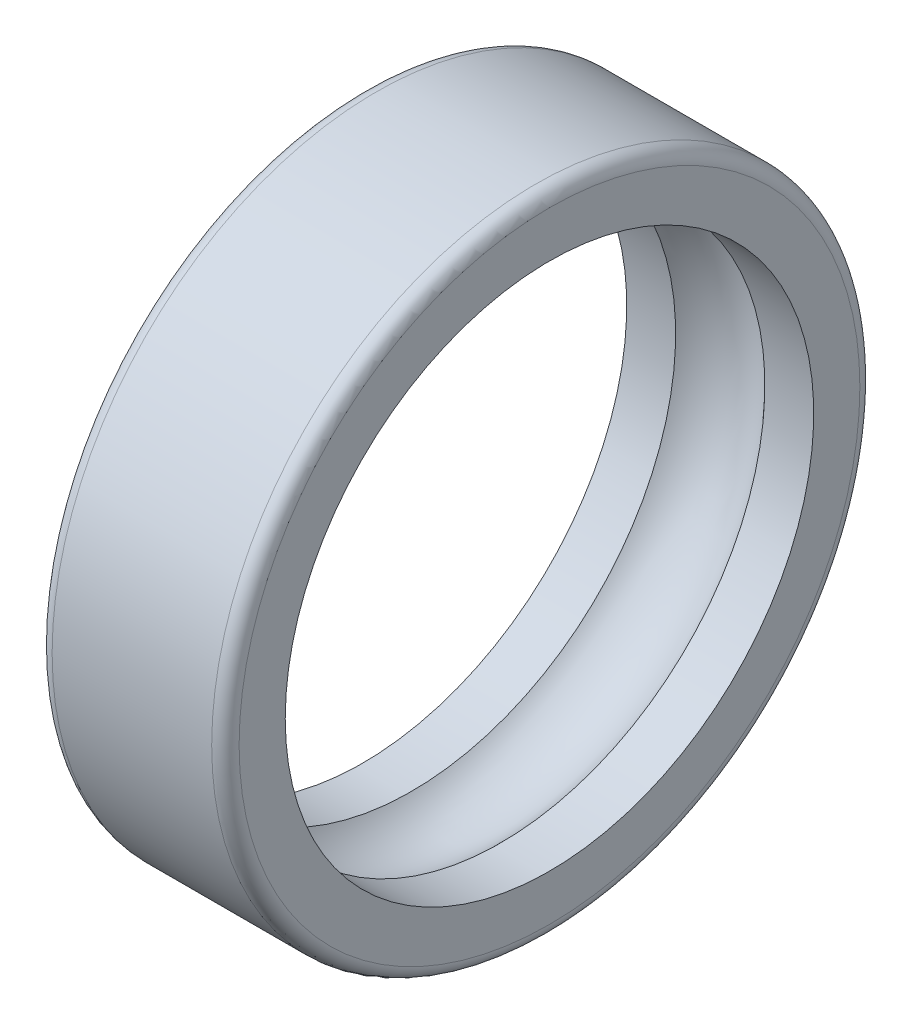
from build123d import *


with BuildPart() as part:
    # Esquisse1 → Base-R_volution (revolve)
    with BuildSketch(Plane(origin=(0, 0, 0), x_dir=(1, 0, 0), z_dir=(0, 1, 0)), mode=Mode.PRIVATE) as base_r_volution_sk:
        with BuildLine():
            Line((0, 24.9), (0, 21.2))
            Line((0, 21.2), (3.922291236, 21.2))
            ThreePointArc((3.922291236, 21.2), (7.5, 22.8), (11.077708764, 21.2))
            Line((11.077708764, 21.2), (15, 21.2))
            Line((15, 21.2), (15, 24.9))
            ThreePointArc((15, 24.9), (14.677817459, 25.677817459), (13.9, 26))
            Line((13.9, 26), (1.1, 26))
            ThreePointArc((1.1, 26), (0.322182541, 25.677817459), (0, 24.9))
        make_face()
    revolve(base_r_volution_sk.sketch.rotate(Axis((0, 0, 0), (1, 0, 0)), 180), axis=Axis((0, 0, 0), (1, 0, 0)))


solid = part.part
